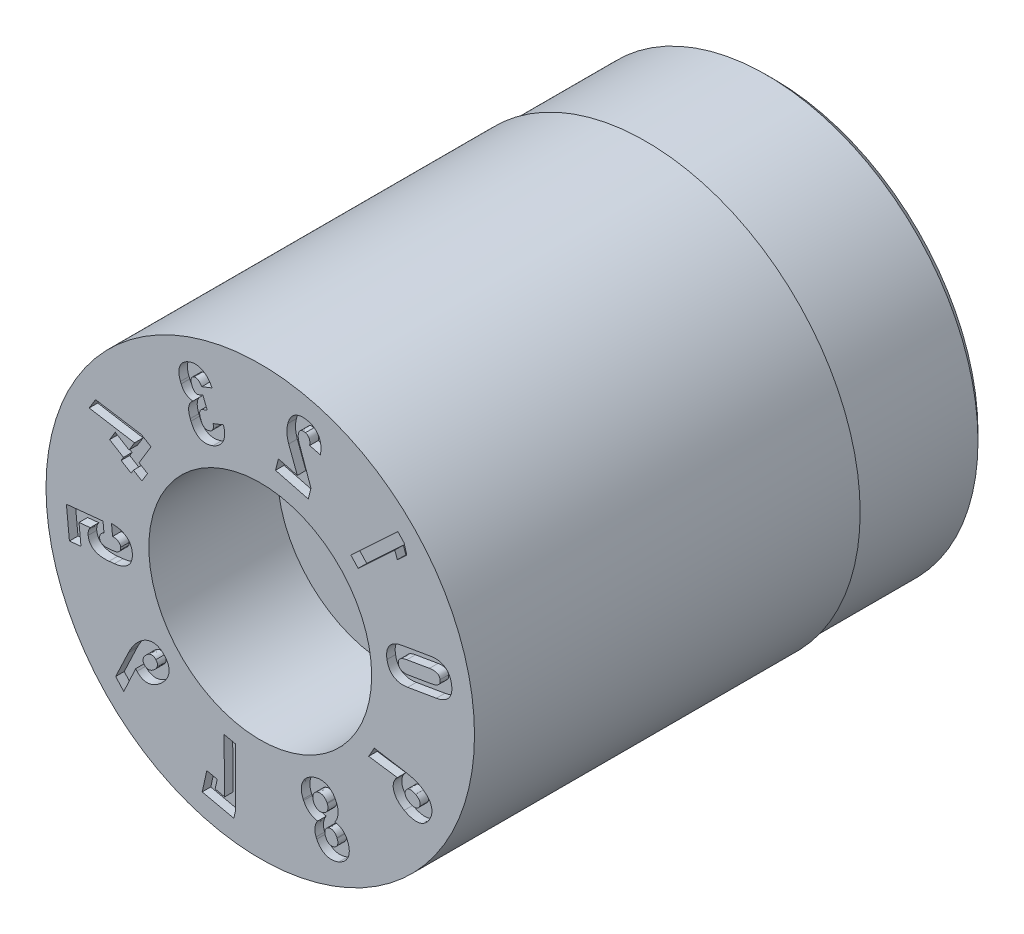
from build123d import *

# Parameters (mm, degrees)
SKETCH4_W          = 3
SKETCH4_H          = 1
CUT_EXTRUDE1_DEPTH = 0.2


with BuildPart() as part:
    # Sketch1 → Revolve1 (revolve)
    with BuildSketch(Plane(origin=(0, 0, 0), x_dir=(0, 0, -1), z_dir=(1, 0, 0)), mode=Mode.PRIVATE) as revolve1_sk:
        Polygon((0, 5), (0, 2.6), (3, 2.6), (3, 1.25), (12, 1.25), (12, 4.75), (11.75, 5), align=None)
    revolve(revolve1_sk.sketch.rotate(Axis((0, 0, 3.797909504), (0, 0, -1)), 90), axis=Axis((0, 0, 3.797909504), (0, 0, -1)))

    # Sketch4 → Cut-Revolve1 (revolve, cut)
    with BuildSketch(Plane(origin=(0, 0, 0), x_dir=(0, 0, -1), z_dir=(1, 0, 0)), mode=Mode.PRIVATE) as cut_revolve1_sk:
        with Locations((10.5, 5.435)):
            Rectangle(SKETCH4_W, SKETCH4_H)
    revolve(cut_revolve1_sk.sketch.rotate(Axis((0, 0, 0), (0, 0, -1)), 90), axis=Axis((0, 0, 0), (0, 0, -1)), mode=Mode.SUBTRACT)

    # Sketch5 → Cut-Extrude1 (cut)
    # profile 1 of 10: a face of its own
    with BuildSketch(Plane.XY):
        with BuildLine():
            Line((3.442038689, 0.185652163), (4.111467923, 0.300110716))
            add(Edge.make_bspline(
                [(4.111467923, 0.300110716), (4.142758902, 0.30549162), (4.188233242, 0.315841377), (4.245005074, 0.33682368), (4.283426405, 0.354206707), (4.318148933, 0.375061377), (4.349731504, 0.39817617), (4.378371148, 0.42365406), (4.403000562, 0.452352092), (4.424376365, 0.483235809), (4.442138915, 0.516503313), (4.455409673, 0.552192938), (4.465144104, 0.589954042), (4.4703147, 0.62999707), (4.472729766, 0.68785635), (4.467893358, 0.732253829), (4.463092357, 0.762228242)],
                knots=[0, 0, 0, 0, 0.144163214, 0.210739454, 0.274357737, 0.335192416, 0.394128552, 0.451737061, 0.508675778, 0.565266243, 0.621864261, 0.679279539, 0.737617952, 0.798403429, 0.862100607, 1, 1, 1, 1], degree=3))
            add(Edge.make_bspline(
                [(4.463092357, 0.762228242), (4.457683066, 0.792234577), (4.447567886, 0.835760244), (4.42639501, 0.889818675), (4.407987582, 0.925823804), (4.38651555, 0.958427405), (4.361891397, 0.987307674), (4.334627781, 1.013029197), (4.304450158, 1.035222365), (4.271491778, 1.053425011), (4.236437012, 1.068632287), (4.198977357, 1.080112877), (4.159060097, 1.087410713), (4.117072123, 1.091346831), (4.056322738, 1.092399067), (4.009807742, 1.086943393), (3.978312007, 1.081569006)],
                knots=[0, 0, 0, 0, 0.138377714, 0.201713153, 0.262803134, 0.321405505, 0.378290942, 0.434495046, 0.491005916, 0.547635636, 0.604850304, 0.663987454, 0.724844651, 0.788507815, 0.855017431, 1, 1, 1, 1], degree=3))
            Line((3.978312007, 1.081569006), (3.308882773, 0.967110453))
            add(Edge.make_bspline(
                [(3.308882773, 0.967110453), (3.277591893, 0.961729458), (3.232117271, 0.951379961), (3.175345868, 0.930397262), (3.136923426, 0.913015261), (3.102204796, 0.89215699), (3.07060835, 0.869055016), (3.041952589, 0.843471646), (3.017092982, 0.814864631), (2.995585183, 0.783853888), (2.978195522, 0.750485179), (2.96477245, 0.714834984), (2.955541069, 0.677067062), (2.949565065, 0.637106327), (2.947481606, 0.579266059), (2.952013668, 0.534908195), (2.957258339, 0.504992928)],
                knots=[0, 0, 0, 0, 0.144140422, 0.210706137, 0.274314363, 0.335139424, 0.394066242, 0.451665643, 0.508997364, 0.565578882, 0.622482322, 0.679237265, 0.737951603, 0.798530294, 0.862217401, 1, 1, 1, 1], degree=3))
            add(Edge.make_bspline(
                [(2.957258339, 0.504992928), (2.962770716, 0.475023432), (2.972617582, 0.431289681), (2.99429882, 0.377284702), (3.013093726, 0.341353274), (3.034528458, 0.308732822), (3.059085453, 0.279634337), (3.087025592, 0.254400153), (3.117532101, 0.232204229), (3.150706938, 0.213813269), (3.186008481, 0.198735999), (3.223636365, 0.187650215), (3.26335059, 0.179905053), (3.305173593, 0.175846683), (3.365184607, 0.175175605), (3.411016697, 0.180624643), (3.442038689, 0.185652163)],
                knots=[0, 0, 0, 0, 0.138543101, 0.202434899, 0.263662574, 0.322334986, 0.379288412, 0.435991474, 0.492832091, 0.550182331, 0.607806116, 0.666740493, 0.727903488, 0.79122346, 0.857218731, 1, 1, 1, 1], degree=3))
        make_face()
        with BuildLine():
            Line((3.421759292, 0.733004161), (3.949379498, 0.82314288))
            add(Edge.make_bspline(
                [(3.949379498, 0.82314288), (3.981110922, 0.829171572), (4.026802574, 0.832602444), (4.084387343, 0.8279312), (4.114216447, 0.819255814), (4.135102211, 0.809904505), (4.148587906, 0.800989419), (4.160385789, 0.79054872), (4.171272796, 0.779132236), (4.17963901, 0.765430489), (4.189710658, 0.74511444), (4.193756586, 0.728079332), (4.195958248, 0.716474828)],
                knots=[0, 0, 0, 0, 0.317667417, 0.449745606, 0.567072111, 0.621755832, 0.674782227, 0.725604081, 0.776899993, 0.829515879, 0.883081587, 1, 1, 1, 1], degree=3))
            add(Edge.make_bspline(
                [(4.195958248, 0.716474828), (4.199859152, 0.694418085), (4.199763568, 0.659890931), (4.179869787, 0.62010483), (4.157197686, 0.595580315), (4.127575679, 0.574503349), (4.07503516, 0.550427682), (4.030467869, 0.53927581), (3.998692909, 0.533928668)],
                knots=[0, 0, 0, 0, 0.223085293, 0.325467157, 0.432104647, 0.549494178, 0.68194998, 1, 1, 1, 1], degree=3))
            Line((3.998692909, 0.533928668), (3.471072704, 0.443789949))
            add(Edge.make_bspline(
                [(3.471072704, 0.443789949), (3.439377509, 0.437978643), (3.39354525, 0.433963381), (3.336048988, 0.439440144), (3.306117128, 0.44775007), (3.285588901, 0.457513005), (3.272091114, 0.466149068), (3.260003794, 0.476198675), (3.249538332, 0.488019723), (3.241076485, 0.501580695), (3.231048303, 0.52193692), (3.226974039, 0.538945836), (3.224782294, 0.550559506)],
                knots=[0, 0, 0, 0, 0.317972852, 0.450609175, 0.568048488, 0.622069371, 0.674350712, 0.725725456, 0.776685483, 0.829351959, 0.88296917, 1, 1, 1, 1], degree=3))
            add(Edge.make_bspline(
                [(3.224782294, 0.550559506), (3.220819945, 0.572630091), (3.221086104, 0.607042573), (3.240664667, 0.646879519), (3.263035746, 0.671819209), (3.293130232, 0.692290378), (3.345405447, 0.716691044), (3.390038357, 0.727607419), (3.421759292, 0.733004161)],
                knots=[0, 0, 0, 0, 0.223205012, 0.324923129, 0.432105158, 0.550244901, 0.681771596, 1, 1, 1, 1], degree=3))
        make_face(mode=Mode.SUBTRACT)
    # profile 2 of 10: a face of its own
    with BuildSketch(Plane.XY):
        Polygon((2.114196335, 2.195059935), (2.285194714, 2.011760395), (3.139672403, 2.808285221), (3.199139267, 2.642619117), (3.418833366, 2.847529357), (3.357563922, 3.061739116), (3.211645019, 3.218150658), align=None)
    # profile 3 of 10: a face of its own
    with BuildSketch(Plane.XY):
        with BuildLine():
            Line((1.183284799, 3.079497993), (0.90978407, 3.851586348))
            add(Edge.make_bspline(
                [(0.90978407, 3.851586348), (0.897817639, 3.884711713), (0.882464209, 3.949264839), (0.885010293, 4.015692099), (0.892303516, 4.045461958)],
                knots=[0, 0, 0, 0, 0.53589203, 1, 1, 1, 1], degree=3))
            Line((0.892303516, 4.045461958), (0.892920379, 4.047216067))
            add(Edge.make_bspline(
                [(0.892920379, 4.047216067), (0.897386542, 4.064957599), (0.907255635, 4.090318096), (0.930005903, 4.116545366), (0.949660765, 4.130810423), (0.972313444, 4.140258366), (1.007757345, 4.146589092), (1.035692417, 4.14189525), (1.054246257, 4.137405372)],
                knots=[0, 0, 0, 0, 0.2623676, 0.378380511, 0.490843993, 0.605685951, 0.72552237, 1, 1, 1, 1], degree=3))
            add(Edge.make_bspline(
                [(1.054246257, 4.137405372), (1.072746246, 4.132492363), (1.099875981, 4.120674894), (1.126425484, 4.092636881), (1.141546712, 4.067477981), (1.152190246, 4.038190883), (1.159986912, 3.991540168), (1.15659034, 3.954426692), (1.153105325, 3.929081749)],
                knots=[0, 0, 0, 0, 0.226271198, 0.335155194, 0.448128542, 0.568444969, 0.698557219, 1, 1, 1, 1], degree=3))
            Line((1.153105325, 3.929081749), (1.402400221, 3.864053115))
            add(Edge.make_bspline(
                [(1.402400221, 3.864053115), (1.411201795, 3.908278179), (1.418499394, 3.97254517), (1.41547839, 4.056289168), (1.406268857, 4.113692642), (1.39136751, 4.167248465), (1.369572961, 4.216175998), (1.342382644, 4.260582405), (1.309100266, 4.29995758), (1.27041812, 4.334277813), (1.210681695, 4.373225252), (1.159782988, 4.39264345), (1.124384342, 4.401683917)],
                knots=[0, 0, 0, 0, 0.196016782, 0.285997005, 0.371478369, 0.453744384, 0.532242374, 0.608662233, 0.684324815, 0.760431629, 0.837613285, 1, 1, 1, 1], degree=3))
            add(Edge.make_bspline(
                [(1.124384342, 4.401683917), (1.086743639, 4.4112999), (1.030629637, 4.420921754), (0.957037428, 4.419275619), (0.906723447, 4.411333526), (0.859531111, 4.396959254), (0.816115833, 4.375710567), (0.776535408, 4.348061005), (0.741061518, 4.31402376), (0.709711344, 4.274097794), (0.672656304, 4.210969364), (0.654519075, 4.157328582), (0.644486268, 4.12014578)],
                knots=[0, 0, 0, 0, 0.184582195, 0.268007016, 0.348282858, 0.425562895, 0.501219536, 0.5766859, 0.653756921, 0.733643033, 0.816841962, 1, 1, 1, 1], degree=3))
            Line((0.644486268, 4.12014578), (0.644164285, 4.118927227))
            add(Edge.make_bspline(
                [(0.644164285, 4.118927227), (0.635655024, 4.085850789), (0.626610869, 4.035049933), (0.622704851, 3.96619099), (0.623506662, 3.913991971), (0.62798301, 3.862196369), (0.638614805, 3.794964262), (0.652758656, 3.746206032), (0.664104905, 3.714670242)],
                knots=[0, 0, 0, 0, 0.249452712, 0.37563126, 0.503311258, 0.630476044, 0.755097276, 1, 1, 1, 1], degree=3))
            Line((0.664104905, 3.714670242), (0.865330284, 3.179539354))
            Line((0.865330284, 3.179539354), (0.424105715, 3.293365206))
            Line((0.424105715, 3.293365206), (0.35586918, 3.028737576))
            Line((0.35586918, 3.028737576), (1.119556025, 2.831930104))
            Line((1.119556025, 2.831930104), (1.183284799, 3.079497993))
        make_face()
    # profile 4 of 10: a face of its own
    with BuildSketch(Plane.XY):
        with BuildLine():
            Line((-0.860001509, 3.339760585), (-1.100641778, 3.245164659))
            add(Edge.make_bspline(
                [(-1.100641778, 3.245164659), (-1.096856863, 3.231154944), (-1.092560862, 3.210154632), (-1.092229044, 3.182507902), (-1.093555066, 3.163380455), (-1.097462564, 3.145565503), (-1.103415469, 3.129085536), (-1.110737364, 3.113623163), (-1.130611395, 3.084966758), (-1.155409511, 3.06750336), (-1.177342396, 3.059293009)],
                knots=[0, 0, 0, 0, 0.196130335, 0.28661623, 0.372202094, 0.45414816, 0.53158122, 0.608131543, 0.68413737, 1, 1, 1, 1], degree=3))
            add(Edge.make_bspline(
                [(-1.177342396, 3.059293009), (-1.197262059, 3.051481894), (-1.228460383, 3.044080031), (-1.269398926, 3.049090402), (-1.297173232, 3.059604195), (-1.322138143, 3.076982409), (-1.353947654, 3.109006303), (-1.369322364, 3.141175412), (-1.37867681, 3.163364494)],
                knots=[0, 0, 0, 0, 0.250952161, 0.364061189, 0.476788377, 0.593888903, 0.716405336, 1, 1, 1, 1], degree=3))
            Line((-1.37867681, 3.163364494), (-1.391362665, 3.195827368))
            add(Edge.make_bspline(
                [(-1.391362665, 3.195827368), (-1.400392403, 3.219444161), (-1.411693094, 3.254171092), (-1.414772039, 3.300101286), (-1.411232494, 3.329342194), (-1.402740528, 3.355296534), (-1.382924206, 3.384915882), (-1.359857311, 3.399498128), (-1.343224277, 3.405643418)],
                knots=[0, 0, 0, 0, 0.313558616, 0.445895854, 0.565659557, 0.675482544, 0.780223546, 1, 1, 1, 1], degree=3))
            Line((-1.343224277, 3.405643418), (-1.238800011, 3.446910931))
            Line((-1.238800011, 3.446910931), (-1.337956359, 3.699177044))
            Line((-1.337956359, 3.699177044), (-1.442380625, 3.65790953))
            add(Edge.make_bspline(
                [(-1.442380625, 3.65790953), (-1.455868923, 3.65268385), (-1.478233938, 3.648855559), (-1.506610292, 3.657257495), (-1.526886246, 3.668592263), (-1.545589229, 3.685704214), (-1.570539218, 3.716292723), (-1.583293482, 3.744988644), (-1.591702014, 3.764886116)],
                knots=[0, 0, 0, 0, 0.212794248, 0.315515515, 0.426435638, 0.548884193, 0.682940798, 1, 1, 1, 1], degree=3))
            Line((-1.591702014, 3.764886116), (-1.601015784, 3.788793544))
            add(Edge.make_bspline(
                [(-1.601015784, 3.788793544), (-1.608295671, 3.807841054), (-1.617187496, 3.836174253), (-1.617784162, 3.873611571), (-1.613905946, 3.897797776), (-1.605130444, 3.919363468), (-1.586457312, 3.944262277), (-1.566280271, 3.957082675), (-1.551354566, 3.962434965)],
                knots=[0, 0, 0, 0, 0.301458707, 0.428676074, 0.547273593, 0.659178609, 0.767261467, 1, 1, 1, 1], degree=3))
            add(Edge.make_bspline(
                [(-1.551354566, 3.962434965), (-1.541233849, 3.96648456), (-1.525093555, 3.970683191), (-1.503086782, 3.969867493), (-1.486483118, 3.967458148), (-1.46994188, 3.96229547), (-1.453799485, 3.954271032), (-1.437715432, 3.944221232), (-1.421926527, 3.931607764), (-1.406418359, 3.916823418), (-1.386189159, 3.892876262), (-1.372530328, 3.872883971), (-1.364292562, 3.85843944)],
                knots=[0, 0, 0, 0, 0.140426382, 0.209784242, 0.281470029, 0.355271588, 0.431039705, 0.512244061, 0.598245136, 0.689934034, 0.786783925, 1, 1, 1, 1], degree=3))
            Line((-1.364292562, 3.85843944), (-1.124308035, 3.952842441))
            add(Edge.make_bspline(
                [(-1.124308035, 3.952842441), (-1.14342868, 3.991435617), (-1.175336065, 4.046295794), (-1.228620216, 4.10900614), (-1.270249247, 4.148599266), (-1.314534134, 4.181457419), (-1.360884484, 4.207488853), (-1.409098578, 4.226193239), (-1.458671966, 4.238059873), (-1.509187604, 4.242579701), (-1.577551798, 4.239607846), (-1.627675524, 4.22592344), (-1.659853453, 4.213519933)],
                knots=[0, 0, 0, 0, 0.195869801, 0.286194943, 0.372900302, 0.456211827, 0.535961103, 0.613567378, 0.690310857, 0.766664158, 0.843151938, 1, 1, 1, 1], degree=3))
            add(Edge.make_bspline(
                [(-1.659853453, 4.213519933), (-1.685830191, 4.203465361), (-1.722923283, 4.186032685), (-1.767330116, 4.15669876), (-1.796520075, 4.133533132), (-1.82207286, 4.108143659), (-1.843895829, 4.080604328), (-1.862490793, 4.051158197), (-1.877433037, 4.019650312), (-1.888700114, 3.986440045), (-1.896741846, 3.951878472), (-1.89970839, 3.915889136), (-1.900258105, 3.878594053), (-1.896110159, 3.839962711), (-1.886016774, 3.785042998), (-1.87199966, 3.744337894), (-1.861608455, 3.716970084)],
                knots=[0, 0, 0, 0, 0.137079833, 0.200603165, 0.261411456, 0.320081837, 0.377350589, 0.433877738, 0.491019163, 0.548417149, 0.606105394, 0.665038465, 0.725662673, 0.789312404, 0.85577091, 1, 1, 1, 1], degree=3))
            Line((-1.861608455, 3.716970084), (-1.845149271, 3.675072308))
            add(Edge.make_bspline(
                [(-1.845149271, 3.675072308), (-1.832957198, 3.644928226), (-1.811121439, 3.601616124), (-1.770137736, 3.553503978), (-1.736331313, 3.523371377), (-1.699097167, 3.498898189), (-1.644481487, 3.474822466), (-1.600018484, 3.466726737), (-1.569921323, 3.465630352)],
                knots=[0, 0, 0, 0, 0.266463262, 0.391488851, 0.514434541, 0.635393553, 0.754011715, 1, 1, 1, 1], degree=3))
            add(Edge.make_bspline(
                [(-1.569921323, 3.465630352), (-1.582622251, 3.455976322), (-1.60137153, 3.440849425), (-1.621140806, 3.416075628), (-1.634950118, 3.39713716), (-1.64566216, 3.376129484), (-1.655054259, 3.354208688), (-1.662123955, 3.330735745), (-1.667040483, 3.305987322), (-1.670048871, 3.280208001), (-1.67137657, 3.253555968), (-1.669867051, 3.226146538), (-1.667222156, 3.197879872), (-1.661753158, 3.168830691), (-1.65183248, 3.128220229), (-1.641003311, 3.098056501), (-1.633489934, 3.077708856)],
                knots=[0, 0, 0, 0, 0.113019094, 0.168119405, 0.223243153, 0.278028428, 0.334007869, 0.391337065, 0.450581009, 0.51178534, 0.574305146, 0.638549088, 0.705255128, 0.774443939, 0.846844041, 1, 1, 1, 1], degree=3))
            Line((-1.633489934, 3.077708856), (-1.616822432, 3.035587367))
            add(Edge.make_bspline(
                [(-1.616822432, 3.035587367), (-1.602307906, 2.997679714), (-1.575638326, 2.94478373), (-1.530796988, 2.882604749), (-1.494030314, 2.844627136), (-1.454426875, 2.812910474), (-1.41141096, 2.788527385), (-1.365503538, 2.77145941), (-1.316915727, 2.761400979), (-1.266024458, 2.759054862), (-1.193170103, 2.764668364), (-1.139136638, 2.78150652), (-1.103273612, 2.794943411)],
                knots=[0, 0, 0, 0, 0.188754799, 0.274214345, 0.355784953, 0.43397937, 0.509562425, 0.584842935, 0.661021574, 0.739491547, 0.821173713, 1, 1, 1, 1], degree=3))
            add(Edge.make_bspline(
                [(-1.103273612, 2.794943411), (-1.067619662, 2.808875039), (-1.016967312, 2.834773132), (-0.958483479, 2.880668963), (-0.920745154, 2.918551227), (-0.888950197, 2.960576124), (-0.863863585, 3.006544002), (-0.844653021, 3.055727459), (-0.833133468, 3.10847142), (-0.827831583, 3.163778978), (-0.832569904, 3.242348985), (-0.846182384, 3.301139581), (-0.860001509, 3.339760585)],
                knots=[0, 0, 0, 0, 0.171988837, 0.253259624, 0.332931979, 0.411461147, 0.489009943, 0.567379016, 0.64770681, 0.730649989, 0.816058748, 1, 1, 1, 1], degree=3))
        make_face()
    # profile 5 of 10: a face of its own
    with BuildSketch(Plane.XY):
        Polygon((-2.770650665, 2.184954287), (-3.844388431, 2.356944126), (-3.992155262, 2.113930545), (-2.934646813, 1.938730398), (-3.060934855, 1.73122771), (-3.384589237, 1.928193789), (-3.515206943, 1.713284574), (-3.191682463, 1.51639755), (-3.246128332, 1.426938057), (-3.013723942, 1.285737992), (-2.959395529, 1.375034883), (-2.762328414, 1.255105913), (-2.631710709, 1.470015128), (-2.828680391, 1.589884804), (-2.548715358, 2.0500493), align=None)
    # profile 6 of 10: a face of its own
    with BuildSketch(Plane.XY):
        with BuildLine():
            Line((-3.469988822, 0.039188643), (-3.471186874, 0.038944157))
            Line((-3.471186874, 0.038944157), (-3.446354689, -0.209632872))
            Line((-3.446354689, -0.209632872), (-3.445156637, -0.209388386))
            add(Edge.make_bspline(
                [(-3.445156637, -0.209388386), (-3.420317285, -0.20931344), (-3.384192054, -0.211787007), (-3.340467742, -0.22615125), (-3.313494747, -0.240400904), (-3.290922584, -0.258341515), (-3.267969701, -0.28813699), (-3.259982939, -0.315571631), (-3.258103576, -0.334073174)],
                knots=[0, 0, 0, 0, 0.300283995, 0.430614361, 0.551790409, 0.666054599, 0.775303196, 1, 1, 1, 1], degree=3))
            add(Edge.make_bspline(
                [(-3.258103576, -0.334073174), (-3.25566766, -0.35388723), (-3.25867243, -0.383862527), (-3.27621085, -0.419183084), (-3.29629744, -0.441018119), (-3.321430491, -0.45972697), (-3.365169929, -0.479771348), (-3.402396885, -0.486790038), (-3.428533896, -0.489591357)],
                knots=[0, 0, 0, 0, 0.229576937, 0.337414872, 0.448973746, 0.568227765, 0.696393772, 1, 1, 1, 1], degree=3))
            Line((-3.428533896, -0.489591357), (-3.55330224, -0.501949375))
            add(Edge.make_bspline(
                [(-3.55330224, -0.501949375), (-3.579407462, -0.504828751), (-3.617050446, -0.505312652), (-3.663765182, -0.496360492), (-3.691890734, -0.484749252), (-3.714988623, -0.469098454), (-3.738650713, -0.441924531), (-3.746842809, -0.415722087), (-3.748607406, -0.397979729)],
                knots=[0, 0, 0, 0, 0.316773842, 0.450543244, 0.570862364, 0.681251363, 0.784141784, 1, 1, 1, 1], degree=3))
            add(Edge.make_bspline(
                [(-3.748607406, -0.397979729), (-3.750425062, -0.381147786), (-3.749127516, -0.355967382), (-3.739243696, -0.324346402), (-3.727633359, -0.303005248), (-3.712252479, -0.283840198), (-3.686665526, -0.2607699), (-3.662744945, -0.249117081), (-3.646160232, -0.24260746)],
                knots=[0, 0, 0, 0, 0.251599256, 0.369677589, 0.490201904, 0.610726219, 0.733694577, 1, 1, 1, 1], degree=3))
            Line((-3.646160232, -0.24260746), (-3.669550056, -0.010271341))
            Line((-3.669550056, -0.010271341), (-4.524346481, -0.096105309))
            Line((-4.524346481, -0.096105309), (-4.453290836, -0.805100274))
            Line((-4.453290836, -0.805100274), (-4.183320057, -0.778086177))
            Line((-4.183320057, -0.778086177), (-4.229543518, -0.31766824))
            Line((-4.229543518, -0.31766824), (-3.966944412, -0.29122252))
            add(Edge.make_bspline(
                [(-3.966944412, -0.29122252), (-3.976713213, -0.301958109), (-3.988520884, -0.321031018), (-4.000704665, -0.349223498), (-4.015447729, -0.396283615), (-4.018486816, -0.438344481), (-4.015699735, -0.471204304)],
                knots=[0, 0, 0, 0, 0.226849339, 0.349811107, 0.481607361, 1, 1, 1, 1], degree=3))
            add(Edge.make_bspline(
                [(-4.015699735, -0.471204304), (-4.012941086, -0.50344915), (-4.001555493, -0.550212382), (-3.973277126, -0.606305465), (-3.94585009, -0.642835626), (-3.912213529, -0.67429205), (-3.872918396, -0.700878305), (-3.828081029, -0.72256162), (-3.777613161, -0.738598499), (-3.721951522, -0.7496289), (-3.638225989, -0.757873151), (-3.572829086, -0.754693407), (-3.528170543, -0.750465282)],
                knots=[0, 0, 0, 0, 0.152893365, 0.224938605, 0.295881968, 0.367836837, 0.441812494, 0.519524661, 0.602636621, 0.691634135, 0.787540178, 1, 1, 1, 1], degree=3))
            Line((-3.528170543, -0.750465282), (-3.403402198, -0.738107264))
            add(Edge.make_bspline(
                [(-3.403402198, -0.738107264), (-3.358674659, -0.733662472), (-3.293949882, -0.722541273), (-3.2141542, -0.694319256), (-3.162283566, -0.668775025), (-3.116150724, -0.638663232), (-3.076826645, -0.60329233), (-3.044040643, -0.563446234), (-3.018169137, -0.519069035), (-2.99920831, -0.470456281), (-2.982902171, -0.398379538), (-2.983129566, -0.341376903), (-2.986769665, -0.303037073)],
                knots=[0, 0, 0, 0, 0.197590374, 0.28663354, 0.370863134, 0.45097033, 0.527795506, 0.602228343, 0.676702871, 0.752418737, 0.830526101, 1, 1, 1, 1], degree=3))
            add(Edge.make_bspline(
                [(-2.986769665, -0.303037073), (-2.989890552, -0.26893093), (-3.001332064, -0.219002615), (-3.029903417, -0.157824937), (-3.057573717, -0.116190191), (-3.091134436, -0.078648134), (-3.130638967, -0.045869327), (-3.175528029, -0.017778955), (-3.225965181, 0.004846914), (-3.281023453, 0.022408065), (-3.362448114, 0.038718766), (-3.426500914, 0.040618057), (-3.469988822, 0.039188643)],
                knots=[0, 0, 0, 0, 0.155803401, 0.230723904, 0.306257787, 0.382544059, 0.459107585, 0.539154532, 0.622835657, 0.710051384, 0.801708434, 1, 1, 1, 1], degree=3))
        make_face()
    # profile 7 of 10: a face of its own
    with BuildSketch(Plane.XY):
        with BuildLine():
            Line((-2.828314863, -2.026232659), (-2.829323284, -2.027048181))
            add(Edge.make_bspline(
                [(-2.829323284, -2.027048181), (-2.849946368, -2.045729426), (-2.880094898, -2.075718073), (-2.917749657, -2.11936761), (-2.974909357, -2.192471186), (-3.016891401, -2.258690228), (-3.046588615, -2.31422742)],
                knots=[0, 0, 0, 0, 0.230728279, 0.352137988, 0.477792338, 1, 1, 1, 1], degree=3))
            add(Edge.make_bspline(
                [(-3.046588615, -2.31422742), (-3.051556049, -2.324011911), (-3.062347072, -2.342944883), (-3.0712795, -2.362823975), (-3.075817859, -2.372614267)],
                knots=[0, 0, 0, 0, 0.504097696, 1, 1, 1, 1], degree=3))
            Line((-3.075817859, -2.372614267), (-3.374277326, -3.003168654))
            Line((-3.374277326, -3.003168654), (-3.185336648, -3.213425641))
            Line((-3.185336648, -3.213425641), (-2.90549993, -2.609503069))
            add(Edge.make_bspline(
                [(-2.90549993, -2.609503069), (-2.897579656, -2.623746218), (-2.887888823, -2.637003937), (-2.876973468, -2.64908546)],
                knots=[0.765471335, 0.765471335, 0.765471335, 0.765471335, 1, 1, 1, 1], degree=3))
            add(Edge.make_bspline(
                [(-2.876973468, -2.64908546), (-2.854160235, -2.67456551), (-2.816100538, -2.707967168), (-2.757919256, -2.739095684), (-2.713135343, -2.754372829), (-2.666486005, -2.762114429), (-2.61848992, -2.76199531), (-2.569266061, -2.754697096), (-2.518998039, -2.739710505), (-2.467854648, -2.717407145), (-2.396453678, -2.676671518), (-2.3462872, -2.637110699), (-2.313773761, -2.607824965)],
                knots=[0, 0, 0, 0, 0.160688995, 0.234959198, 0.308542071, 0.381866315, 0.455939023, 0.532986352, 0.614722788, 0.701479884, 0.794412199, 1, 1, 1, 1], degree=3))
            add(Edge.make_bspline(
                [(-2.313773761, -2.607824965), (-2.279983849, -2.577247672), (-2.234266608, -2.530395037), (-2.186729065, -2.460664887), (-2.159447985, -2.409734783), (-2.14026998, -2.358205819), (-2.128935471, -2.306672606), (-2.126458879, -2.255290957), (-2.131518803, -2.204414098), (-2.144953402, -2.154256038), (-2.174620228, -2.087076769), (-2.20798604, -2.041334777), (-2.233640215, -2.012892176)],
                knots=[0, 0, 0, 0, 0.197425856, 0.286668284, 0.371343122, 0.451537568, 0.528336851, 0.603021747, 0.677385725, 0.752893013, 0.830960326, 1, 1, 1, 1], degree=3))
            add(Edge.make_bspline(
                [(-2.233640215, -2.012892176), (-2.2589543, -1.9843739), (-2.300808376, -1.946685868), (-2.364255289, -1.910434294), (-2.412381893, -1.891550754), (-2.462071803, -1.880858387), (-2.513009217, -1.877370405), (-2.564900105, -1.883207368), (-2.617722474, -1.896148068), (-2.670732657, -1.917465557), (-2.744477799, -1.95656783), (-2.795367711, -1.996720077), (-2.828314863, -2.026232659)],
                knots=[0, 0, 0, 0, 0.16964344, 0.247739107, 0.323778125, 0.39851072, 0.47286485, 0.54971044, 0.629663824, 0.713946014, 0.8030193, 1, 1, 1, 1], degree=3))
        make_face()
        with BuildLine():
            Line((-2.467103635, -2.409633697), (-2.468112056, -2.410449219))
            add(Edge.make_bspline(
                [(-2.468112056, -2.410449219), (-2.488524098, -2.428763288), (-2.520054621, -2.452673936), (-2.565690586, -2.472903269), (-2.59718235, -2.479842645), (-2.627164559, -2.479698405), (-2.665806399, -2.469612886), (-2.69004091, -2.450670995), (-2.703473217, -2.435662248)],
                knots=[0, 0, 0, 0, 0.308281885, 0.439310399, 0.557168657, 0.667400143, 0.772658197, 1, 1, 1, 1], degree=3))
            add(Edge.make_bspline(
                [(-2.703473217, -2.435662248), (-2.717204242, -2.421001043), (-2.732583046, -2.394608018), (-2.738395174, -2.35515813), (-2.73490826, -2.324956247), (-2.724262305, -2.294263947), (-2.699517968, -2.25074), (-2.672012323, -2.222294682), (-2.651902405, -2.203810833)],
                knots=[0, 0, 0, 0, 0.224997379, 0.331057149, 0.441806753, 0.562303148, 0.692732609, 1, 1, 1, 1], degree=3))
            add(Edge.make_bspline(
                [(-2.651902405, -2.203810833), (-2.63382234, -2.187201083), (-2.605914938, -2.166609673), (-2.56481721, -2.15113296), (-2.536057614, -2.146388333), (-2.508117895, -2.148871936), (-2.471348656, -2.160237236), (-2.44882479, -2.180126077), (-2.435429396, -2.194428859)],
                knots=[0, 0, 0, 0, 0.293279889, 0.41699891, 0.534274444, 0.646454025, 0.757163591, 1, 1, 1, 1], degree=3))
            add(Edge.make_bspline(
                [(-2.435429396, -2.194428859), (-2.42224554, -2.20939851), (-2.405055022, -2.234351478), (-2.397445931, -2.272453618), (-2.398242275, -2.300527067), (-2.405680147, -2.328883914), (-2.426303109, -2.367815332), (-2.449216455, -2.393719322), (-2.467103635, -2.409633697)],
                knots=[0, 0, 0, 0, 0.24510279, 0.355626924, 0.467497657, 0.584047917, 0.708789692, 1, 1, 1, 1], degree=3))
        make_face(mode=Mode.SUBTRACT)
    # profile 8 of 10: a face of its own
    with BuildSketch(Plane.XY):
        Polygon((-0.575825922, -4.308016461), (-0.582571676, -2.967707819), (-0.846322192, -2.909068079), (-0.830642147, -4.165166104), (-1.052564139, -4.115924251), (-1.003673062, -3.896199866), (-1.246924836, -3.842065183), (-1.354566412, -4.326500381), (-0.616426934, -4.490455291), align=None)
    # profile 9 of 10: a face of its own
    with BuildSketch(Plane.XY):
        with BuildLine():
            Line((1.001808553, -3.29308817), (1.012067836, -3.315938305))
            add(Edge.make_bspline(
                [(1.012067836, -3.315938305), (1.026986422, -3.349589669), (1.055372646, -3.397508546), (1.105241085, -3.452195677), (1.147271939, -3.488494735), (1.192813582, -3.519209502), (1.256408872, -3.550557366), (1.307832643, -3.562683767), (1.342161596, -3.56613179)],
                knots=[0, 0, 0, 0, 0.254902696, 0.381809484, 0.510931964, 0.638527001, 0.761101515, 1, 1, 1, 1], degree=3))
            add(Edge.make_bspline(
                [(1.342161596, -3.56613179), (1.324503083, -3.589610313), (1.302078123, -3.628374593), (1.284765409, -3.685460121), (1.276624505, -3.730246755), (1.274302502, -3.775814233), (1.27842008, -3.835995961), (1.292091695, -3.879211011), (1.303739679, -3.906602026)],
                knots=[0, 0, 0, 0, 0.245950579, 0.369855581, 0.497299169, 0.625718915, 0.750476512, 1, 1, 1, 1], degree=3))
            Line((1.303739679, -3.906602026), (1.319864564, -3.942571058))
            add(Edge.make_bspline(
                [(1.319864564, -3.942571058), (1.334925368, -3.976658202), (1.36225022, -4.024617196), (1.409286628, -4.07922049), (1.447864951, -4.113223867), (1.489635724, -4.14105906), (1.534092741, -4.162708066), (1.581428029, -4.176848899), (1.630877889, -4.184762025), (1.681990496, -4.185847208), (1.753022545, -4.177300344), (1.805009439, -4.159888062), (1.838843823, -4.145008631)],
                knots=[0, 0, 0, 0, 0.178326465, 0.261809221, 0.343693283, 0.423509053, 0.501235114, 0.579289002, 0.658911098, 0.740109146, 0.823002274, 1, 1, 1, 1], degree=3))
            add(Edge.make_bspline(
                [(1.838843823, -4.145008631), (1.872965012, -4.130392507), (1.920203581, -4.102630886), (1.974744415, -4.056148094), (2.008170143, -4.0174469), (2.035923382, -3.975694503), (2.056274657, -3.930738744), (2.07073336, -3.883424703), (2.077992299, -3.833745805), (2.078373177, -3.782313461), (2.069123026, -3.71095618), (2.052235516, -3.658462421), (2.036875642, -3.624523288)],
                knots=[0, 0, 0, 0, 0.177240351, 0.260220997, 0.341606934, 0.420996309, 0.499130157, 0.576725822, 0.656865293, 0.738321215, 0.821931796, 1, 1, 1, 1], degree=3))
            Line((2.036875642, -3.624523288), (2.020750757, -3.588554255))
            add(Edge.make_bspline(
                [(2.020750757, -3.588554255), (2.008359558, -3.560902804), (1.984851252, -3.52143536), (1.942576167, -3.47766143), (1.907189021, -3.448730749), (1.868129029, -3.425277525), (1.813815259, -3.400377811), (1.769720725, -3.391886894), (1.740455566, -3.389489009)],
                knots=[0, 0, 0, 0, 0.252380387, 0.377310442, 0.50461534, 0.631436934, 0.755258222, 1, 1, 1, 1], degree=3))
            add(Edge.make_bspline(
                [(1.740455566, -3.389489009), (1.761457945, -3.361565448), (1.786714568, -3.314600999), (1.806717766, -3.246082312), (1.814994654, -3.191727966), (1.816808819, -3.136314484), (1.809488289, -3.062777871), (1.79371806, -3.00947122), (1.778598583, -2.97587796)],
                knots=[0, 0, 0, 0, 0.240868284, 0.364207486, 0.491227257, 0.6194935, 0.745982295, 1, 1, 1, 1], degree=3))
            Line((1.778598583, -2.97587796), (1.768339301, -2.953027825))
            add(Edge.make_bspline(
                [(1.768339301, -2.953027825), (1.752151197, -2.917017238), (1.723588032, -2.865909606), (1.673608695, -2.80826766), (1.63286156, -2.772244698), (1.588576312, -2.742687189), (1.540867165, -2.72077239), (1.490736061, -2.705235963), (1.437940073, -2.697419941), (1.383323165, -2.697141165), (1.307326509, -2.706251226), (1.251727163, -2.72526749), (1.215541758, -2.741065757)],
                knots=[0, 0, 0, 0, 0.177776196, 0.260857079, 0.341955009, 0.421652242, 0.499327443, 0.577213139, 0.656885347, 0.738344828, 0.82213014, 1, 1, 1, 1], degree=3))
            add(Edge.make_bspline(
                [(1.215541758, -2.741065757), (1.179444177, -2.757147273), (1.128485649, -2.786071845), (1.070388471, -2.835675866), (1.034269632, -2.876550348), (1.00500543, -2.920996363), (0.981855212, -2.968244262), (0.967142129, -3.018687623), (0.958772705, -3.071265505), (0.958363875, -3.125705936), (0.967062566, -3.201512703), (0.986298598, -3.256912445), (1.001808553, -3.29308817)],
                knots=[0, 0, 0, 0, 0.177852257, 0.261480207, 0.342612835, 0.422344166, 0.500226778, 0.578341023, 0.657795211, 0.738986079, 0.822461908, 1, 1, 1, 1], degree=3))
        make_face()
        with BuildLine():
            Line((1.557507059, -3.092159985), (1.563599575, -3.105483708))
            add(Edge.make_bspline(
                [(1.563599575, -3.105483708), (1.569911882, -3.120182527), (1.577260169, -3.142664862), (1.580988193, -3.173271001), (1.580668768, -3.195238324), (1.577036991, -3.216544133), (1.571120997, -3.23706774), (1.561903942, -3.256311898), (1.550230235, -3.274421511), (1.535644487, -3.290937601), (1.512162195, -3.31116284), (1.491546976, -3.323002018), (1.47679299, -3.329389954)],
                knots=[0, 0, 0, 0, 0.177812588, 0.260402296, 0.341395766, 0.420793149, 0.499737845, 0.577761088, 0.656811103, 0.738277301, 0.821492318, 1, 1, 1, 1], degree=3))
            add(Edge.make_bspline(
                [(1.47679299, -3.329389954), (1.462237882, -3.336221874), (1.439674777, -3.343430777), (1.409022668, -3.347248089), (1.387028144, -3.346764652), (1.365600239, -3.343698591), (1.345136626, -3.337175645), (1.325703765, -3.328038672), (1.307681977, -3.315701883), (1.290860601, -3.301059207), (1.270563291, -3.277398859), (1.2583062, -3.25699398), (1.252001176, -3.242195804)],
                knots=[0, 0, 0, 0, 0.177488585, 0.259699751, 0.340321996, 0.419970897, 0.498076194, 0.576820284, 0.656453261, 0.738672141, 0.82262358, 1, 1, 1, 1], degree=3))
            Line((1.252001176, -3.242195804), (1.245864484, -3.2280086))
            add(Edge.make_bspline(
                [(1.245864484, -3.2280086), (1.238406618, -3.212308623), (1.230868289, -3.187841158), (1.22602558, -3.15476297), (1.2256088, -3.131048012), (1.228433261, -3.108154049), (1.233863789, -3.086344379), (1.242777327, -3.065969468), (1.25443895, -3.047101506), (1.268727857, -3.029919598), (1.29156918, -3.009107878), (1.311779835, -2.996947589), (1.326351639, -2.990573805)],
                knots=[0, 0, 0, 0, 0.184565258, 0.270820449, 0.355255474, 0.436218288, 0.515795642, 0.59366885, 0.671971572, 0.751230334, 0.830785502, 1, 1, 1, 1], degree=3))
            add(Edge.make_bspline(
                [(1.326351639, -2.990573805), (1.340958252, -2.984102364), (1.363615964, -2.977015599), (1.394677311, -2.974216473), (1.41729625, -2.975336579), (1.439219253, -2.980032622), (1.460450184, -2.987139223), (1.480355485, -2.997947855), (1.499198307, -3.011593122), (1.516342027, -3.028129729), (1.538063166, -3.053698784), (1.550199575, -3.076440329), (1.557507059, -3.092159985)],
                knots=[0, 0, 0, 0, 0.16908007, 0.248383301, 0.32882775, 0.407557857, 0.484814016, 0.564787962, 0.64606531, 0.730144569, 0.816095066, 1, 1, 1, 1], degree=3))
        make_face(mode=Mode.SUBTRACT)
        with BuildLine():
            Line((1.78860877, -3.679212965), (1.79449646, -3.692763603))
            add(Edge.make_bspline(
                [(1.79449646, -3.692763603), (1.80038329, -3.706427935), (1.807679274, -3.727161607), (1.812255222, -3.755436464), (1.812586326, -3.775649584), (1.810476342, -3.795110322), (1.805305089, -3.813428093), (1.798555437, -3.830934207), (1.788854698, -3.847096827), (1.776760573, -3.861672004), (1.757771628, -3.879902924), (1.740072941, -3.889652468), (1.727807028, -3.895295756)],
                knots=[0, 0, 0, 0, 0.186170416, 0.273106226, 0.356915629, 0.438209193, 0.516824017, 0.594201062, 0.672142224, 0.751209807, 0.830441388, 1, 1, 1, 1], degree=3))
            add(Edge.make_bspline(
                [(1.727807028, -3.895295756), (1.715403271, -3.9005339), (1.696336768, -3.907373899), (1.670094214, -3.908954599), (1.651149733, -3.908207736), (1.632781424, -3.904219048), (1.615034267, -3.898071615), (1.598490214, -3.888573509), (1.582392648, -3.87719001), (1.567767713, -3.862881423), (1.549298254, -3.84074245), (1.538866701, -3.821202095), (1.532644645, -3.80766795)],
                knots=[0, 0, 0, 0, 0.168910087, 0.247959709, 0.326507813, 0.404489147, 0.481376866, 0.559626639, 0.641394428, 0.726525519, 0.813817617, 1, 1, 1, 1], degree=3))
            Line((1.532644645, -3.80766795), (1.526281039, -3.793275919))
            add(Edge.make_bspline(
                [(1.526281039, -3.793275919), (1.520049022, -3.778933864), (1.512138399, -3.757173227), (1.507330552, -3.727354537), (1.506492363, -3.70605315), (1.507873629, -3.685499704), (1.512244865, -3.666041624), (1.518677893, -3.647609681), (1.528338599, -3.630798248), (1.539694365, -3.615177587), (1.55875697, -3.596684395), (1.576182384, -3.58644009), (1.588576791, -3.581012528)],
                knots=[0, 0, 0, 0, 0.189172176, 0.277572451, 0.363717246, 0.446170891, 0.525536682, 0.603913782, 0.680926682, 0.758799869, 0.836478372, 1, 1, 1, 1], degree=3))
            add(Edge.make_bspline(
                [(1.588576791, -3.581012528), (1.601040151, -3.576077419), (1.620221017, -3.569104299), (1.646740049, -3.56814147), (1.665987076, -3.569634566), (1.684736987, -3.574069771), (1.702675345, -3.581714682), (1.72015341, -3.591553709), (1.736634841, -3.604489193), (1.751785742, -3.619983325), (1.770964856, -3.643938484), (1.781891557, -3.664808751), (1.78860877, -3.679212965)],
                knots=[0, 0, 0, 0, 0.162043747, 0.239792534, 0.316517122, 0.393056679, 0.469566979, 0.549604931, 0.6329051, 0.719783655, 0.808959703, 1, 1, 1, 1], degree=3))
        make_face(mode=Mode.SUBTRACT)
    # profile 10 of 10: a face of its own
    with BuildSketch(Plane.XY):
        with BuildLine():
            Line((3.359957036, -2.339929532), (3.36095452, -2.340398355))
            add(Edge.make_bspline(
                [(3.36095452, -2.340398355), (3.400139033, -2.362796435), (3.459714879, -2.390878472), (3.541356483, -2.414384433), (3.598565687, -2.42398218), (3.653641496, -2.426309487), (3.705967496, -2.420206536), (3.755685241, -2.407251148), (3.802121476, -2.385757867), (3.845308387, -2.357162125), (3.899381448, -2.30774174), (3.932173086, -2.261852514), (3.950764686, -2.228374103)],
                knots=[0, 0, 0, 0, 0.198763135, 0.288253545, 0.373192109, 0.453553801, 0.530018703, 0.604255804, 0.67874853, 0.754163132, 0.831392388, 1, 1, 1, 1], degree=3))
            add(Edge.make_bspline(
                [(3.950764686, -2.228374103), (3.969526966, -2.19523734), (3.991980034, -2.143539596), (4.005535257, -2.071641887), (4.007437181, -2.019742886), (4.00118556, -1.968699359), (3.986604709, -1.918997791), (3.963818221, -1.870994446), (3.933505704, -1.824564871), (3.895346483, -1.780232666), (3.832333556, -1.72225695), (3.776654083, -1.686053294), (3.737320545, -1.663403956)],
                knots=[0, 0, 0, 0, 0.167046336, 0.244194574, 0.319352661, 0.393688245, 0.46851149, 0.545269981, 0.62566907, 0.710728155, 0.80086835, 1, 1, 1, 1], degree=3))
            add(Edge.make_bspline(
                [(3.737320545, -1.663403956), (3.713750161, -1.65016807), (3.677806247, -1.632307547), (3.626692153, -1.613122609), (3.585429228, -1.598948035), (3.541442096, -1.586599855), (3.478271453, -1.570271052), (3.429145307, -1.560257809), (3.395600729, -1.554130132)],
                knots=[0, 0, 0, 0, 0.217810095, 0.334167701, 0.455470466, 0.581845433, 0.71535041, 1, 1, 1, 1], degree=3))
            add(Edge.make_bspline(
                [(3.395600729, -1.554130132), (3.385669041, -1.551965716), (3.366055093, -1.547624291), (3.346204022, -1.54447659), (3.336328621, -1.543508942)],
                knots=[0, 0, 0, 0, 0.506174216, 1, 1, 1, 1], degree=3))
            Line((3.336328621, -1.543508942), (2.66102722, -1.43361365))
            Line((2.66102722, -1.43361365), (2.531285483, -1.663415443))
            Line((2.531285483, -1.663415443), (3.198496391, -1.76126586))
            add(Edge.make_bspline(
                [(3.198496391, -1.76126586), (3.197504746, -1.762136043), (3.189767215, -1.769071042), (3.169102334, -1.790970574), (3.152414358, -1.814484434), (3.142961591, -1.83174625)],
                knots=[0.574093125, 0.574093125, 0.574093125, 0.574093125, 0.592801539, 0.721437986, 1, 1, 1, 1], degree=3))
            add(Edge.make_bspline(
                [(3.142961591, -1.83174625), (3.12719923, -1.859209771), (3.109277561, -1.903387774), (3.101443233, -1.965441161), (3.102775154, -2.011843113), (3.111591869, -2.058029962), (3.127097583, -2.103717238), (3.150398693, -2.147947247), (3.179708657, -2.191412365), (3.216110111, -2.232559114), (3.273388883, -2.286509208), (3.324508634, -2.319210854), (3.359957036, -2.339929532)],
                knots=[0, 0, 0, 0, 0.15367381, 0.227489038, 0.301796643, 0.377751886, 0.454570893, 0.534764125, 0.61933496, 0.708082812, 0.800481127, 1, 1, 1, 1], degree=3))
        make_face()
        with BuildLine():
            Line((3.490063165, -2.126692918), (3.489065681, -2.126224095))
            add(Edge.make_bspline(
                [(3.489065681, -2.126224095), (3.466308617, -2.113480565), (3.435316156, -2.092108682), (3.403851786, -2.056312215), (3.388522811, -2.029341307), (3.379629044, -2.001378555), (3.378164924, -1.962003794), (3.388497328, -1.933543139), (3.398210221, -1.916116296)],
                knots=[0, 0, 0, 0, 0.302836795, 0.430945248, 0.549066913, 0.65988794, 0.767686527, 1, 1, 1, 1], degree=3))
            add(Edge.make_bspline(
                [(3.398210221, -1.916116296), (3.407880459, -1.898804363), (3.427189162, -1.875474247), (3.46193376, -1.856978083), (3.490615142, -1.85015845), (3.521792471, -1.849596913), (3.568690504, -1.858652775), (3.603106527, -1.87394427), (3.625855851, -1.886807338)],
                knots=[0, 0, 0, 0, 0.230404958, 0.339057, 0.450208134, 0.568540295, 0.697225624, 1, 1, 1, 1], degree=3))
            add(Edge.make_bspline(
                [(3.625855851, -1.886807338), (3.648359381, -1.899771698), (3.678589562, -1.920096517), (3.708302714, -1.955240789), (3.723013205, -1.98161373), (3.731273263, -2.009262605), (3.731959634, -2.048184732), (3.722291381, -2.076464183), (3.712192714, -2.093573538)],
                knots=[0, 0, 0, 0, 0.298302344, 0.425564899, 0.542981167, 0.654467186, 0.764427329, 1, 1, 1, 1], degree=3))
            add(Edge.make_bspline(
                [(3.712192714, -2.093573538), (3.702204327, -2.110733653), (3.683726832, -2.13504488), (3.649121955, -2.153634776), (3.621057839, -2.161015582), (3.590583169, -2.161727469), (3.544956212, -2.154462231), (3.511904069, -2.138876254), (3.490063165, -2.126692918)],
                knots=[0, 0, 0, 0, 0.236924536, 0.346414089, 0.457865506, 0.576250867, 0.703375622, 1, 1, 1, 1], degree=3))
        make_face(mode=Mode.SUBTRACT)
    extrude(amount=-CUT_EXTRUDE1_DEPTH, mode=Mode.SUBTRACT)


solid = part.part
